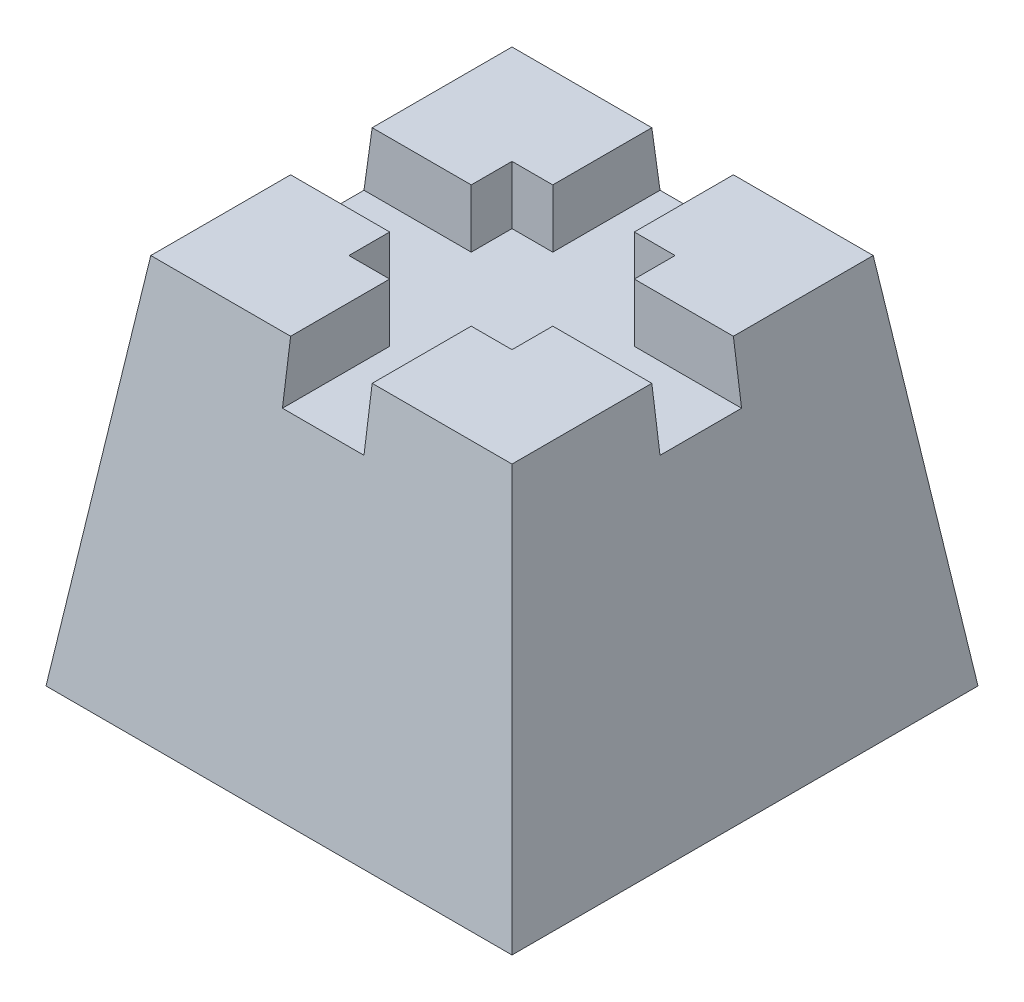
ISO-10303-21;
HEADER;
FILE_DESCRIPTION(('STEP AP214'),'2;1');
FILE_NAME('part.step','',(''),(''),'','','');
FILE_SCHEMA(('AUTOMOTIVE_DESIGN { 1 0 10303 214 1 1 1 1 }'));
ENDSEC;
DATA;
#1=APPLICATION_CONTEXT('core data for automotive mechanical design processes');
#2=APPLICATION_PROTOCOL_DEFINITION('international standard','automotive_design',2000,#1);
#3=PRODUCT_CONTEXT('',#1,'mechanical');
#4=PRODUCT('Part','Part','',(#3));
#5=PRODUCT_RELATED_PRODUCT_CATEGORY('part','',(#4));
#6=PRODUCT_DEFINITION_FORMATION('','',#4);
#7=PRODUCT_DEFINITION_CONTEXT('part definition',#1,'design');
#8=PRODUCT_DEFINITION('design','',#6,#7);
#9=PRODUCT_DEFINITION_SHAPE('','',#8);
#10=(LENGTH_UNIT() NAMED_UNIT(*) SI_UNIT(.MILLI.,.METRE.));
#11=(NAMED_UNIT(*) PLANE_ANGLE_UNIT() SI_UNIT($,.RADIAN.));
#12=(NAMED_UNIT(*) SI_UNIT($,.STERADIAN.) SOLID_ANGLE_UNIT());
#13=UNCERTAINTY_MEASURE_WITH_UNIT(LENGTH_MEASURE(1.E-05),#10,'distance_accuracy_value','');
#14=(GEOMETRIC_REPRESENTATION_CONTEXT(3) GLOBAL_UNCERTAINTY_ASSIGNED_CONTEXT((#13)) GLOBAL_UNIT_ASSIGNED_CONTEXT((#10,
#11,#12)) REPRESENTATION_CONTEXT('',''));
#15=CARTESIAN_POINT('',(0.,0.,0.));
#16=DIRECTION('',(0.,0.,1.));
#17=DIRECTION('',(1.,0.,0.));
#18=AXIS2_PLACEMENT_3D('',#15,#16,#17);
#19=CARTESIAN_POINT('',(-127.,203.2,127.));
#20=DIRECTION('',(0.,1.,0.));
#21=DIRECTION('',(0.,0.,1.));
#22=AXIS2_PLACEMENT_3D('',#19,#20,#21);
#23=PLANE('',#22);
#24=DIRECTION('',(0.,0.,-1.));
#25=VECTOR('',#24,1.);
#26=CARTESIAN_POINT('',(44.45,203.2,44.45));
#27=LINE('',#26,#25);
#28=CARTESIAN_POINT('',(44.45,203.2,-22.225));
#29=VERTEX_POINT('',#28);
#30=CARTESIAN_POINT('',(44.45,203.2,-44.45));
#31=VERTEX_POINT('',#30);
#32=EDGE_CURVE('E190',#29,#31,#27,.T.);
#33=ORIENTED_EDGE('',*,*,#32,.F.);
#34=DIRECTION('',(-1.,0.,0.));
#35=VECTOR('',#34,1.);
#36=CARTESIAN_POINT('',(-127.,203.2,-22.225));
#37=LINE('',#36,#35);
#38=CARTESIAN_POINT('',(98.4421023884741,203.2,-22.225));
#39=VERTEX_POINT('',#38);
#40=EDGE_CURVE('E343',#39,#29,#37,.T.);
#41=ORIENTED_EDGE('',*,*,#40,.F.);
#42=DIRECTION('',(0.,0.,1.));
#43=VECTOR('',#42,1.);
#44=CARTESIAN_POINT('',(98.442102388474,203.2,-127.));
#45=LINE('',#44,#43);
#46=CARTESIAN_POINT('',(98.442102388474,203.2,-98.442102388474));
#47=VERTEX_POINT('',#46);
#48=EDGE_CURVE('E330',#39,#47,#45,.F.);
#49=ORIENTED_EDGE('',*,*,#48,.T.);
#50=DIRECTION('',(1.,0.,0.));
#51=VECTOR('',#50,1.);
#52=CARTESIAN_POINT('',(-127.,203.2,-98.442102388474));
#53=LINE('',#52,#51);
#54=CARTESIAN_POINT('',(22.225,203.2,-98.442102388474));
#55=VERTEX_POINT('',#54);
#56=EDGE_CURVE('E319',#47,#55,#53,.F.);
#57=ORIENTED_EDGE('',*,*,#56,.T.);
#58=DIRECTION('',(0.,0.,-1.));
#59=VECTOR('',#58,1.);
#60=CARTESIAN_POINT('',(22.225,203.2,-127.));
#61=LINE('',#60,#59);
#62=CARTESIAN_POINT('',(22.225,203.2,-44.45));
#63=VERTEX_POINT('',#62);
#64=EDGE_CURVE('E213',#63,#55,#61,.T.);
#65=ORIENTED_EDGE('',*,*,#64,.F.);
#66=DIRECTION('',(-1.,0.,0.));
#67=VECTOR('',#66,1.);
#68=CARTESIAN_POINT('',(44.45,203.2,-44.45));
#69=LINE('',#68,#67);
#70=EDGE_CURVE('E204',#31,#63,#69,.T.);
#71=ORIENTED_EDGE('',*,*,#70,.F.);
#72=EDGE_LOOP('',(#33,#41,#49,#57,#65,#71));
#73=FACE_BOUND('',#72,.T.);
#74=ADVANCED_FACE('F27',(#73),#23,.T.);
#75=CARTESIAN_POINT('',(44.45,203.2,44.45));
#76=VERTEX_POINT('',#75);
#77=CARTESIAN_POINT('',(44.45,203.2,22.225));
#78=VERTEX_POINT('',#77);
#79=EDGE_CURVE('E200',#76,#78,#27,.T.);
#80=ORIENTED_EDGE('',*,*,#79,.F.);
#81=DIRECTION('',(1.,0.,0.));
#82=VECTOR('',#81,1.);
#83=CARTESIAN_POINT('',(44.45,203.2,44.45));
#84=LINE('',#83,#82);
#85=CARTESIAN_POINT('',(22.225,203.2,44.45));
#86=VERTEX_POINT('',#85);
#87=EDGE_CURVE('E221',#86,#76,#84,.T.);
#88=ORIENTED_EDGE('',*,*,#87,.F.);
#89=DIRECTION('',(0.,0.,-1.));
#90=VECTOR('',#89,1.);
#91=CARTESIAN_POINT('',(22.225,203.2,127.));
#92=LINE('',#91,#90);
#93=CARTESIAN_POINT('',(22.225,203.2,98.442102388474));
#94=VERTEX_POINT('',#93);
#95=EDGE_CURVE('E340',#94,#86,#92,.T.);
#96=ORIENTED_EDGE('',*,*,#95,.F.);
#97=DIRECTION('',(-1.,0.,0.));
#98=VECTOR('',#97,1.);
#99=CARTESIAN_POINT('',(-127.,203.2,98.442102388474));
#100=LINE('',#99,#98);
#101=CARTESIAN_POINT('',(98.4421023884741,203.2,98.442102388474));
#102=VERTEX_POINT('',#101);
#103=EDGE_CURVE('E326',#94,#102,#100,.F.);
#104=ORIENTED_EDGE('',*,*,#103,.T.);
#105=CARTESIAN_POINT('',(98.4421023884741,203.2,22.225));
#106=VERTEX_POINT('',#105);
#107=EDGE_CURVE('E331',#102,#106,#45,.F.);
#108=ORIENTED_EDGE('',*,*,#107,.T.);
#109=DIRECTION('',(1.,0.,0.));
#110=VECTOR('',#109,1.);
#111=CARTESIAN_POINT('',(22.225,203.2,22.225));
#112=LINE('',#111,#110);
#113=EDGE_CURVE('E247',#78,#106,#112,.T.);
#114=ORIENTED_EDGE('',*,*,#113,.F.);
#115=EDGE_LOOP('',(#80,#88,#96,#104,#108,#114));
#116=FACE_BOUND('',#115,.T.);
#117=ADVANCED_FACE('F362',(#116),#23,.T.);
#118=CARTESIAN_POINT('',(-44.45,203.2,44.45));
#119=VERTEX_POINT('',#118);
#120=CARTESIAN_POINT('',(-22.225,203.2,44.45));
#121=VERTEX_POINT('',#120);
#122=EDGE_CURVE('E209',#119,#121,#84,.T.);
#123=ORIENTED_EDGE('',*,*,#122,.F.);
#124=DIRECTION('',(0.,0.,1.));
#125=VECTOR('',#124,1.);
#126=CARTESIAN_POINT('',(-44.45,203.2,44.45));
#127=LINE('',#126,#125);
#128=CARTESIAN_POINT('',(-44.45,203.2,22.225));
#129=VERTEX_POINT('',#128);
#130=EDGE_CURVE('E214',#129,#119,#127,.T.);
#131=ORIENTED_EDGE('',*,*,#130,.F.);
#132=DIRECTION('',(1.,0.,0.));
#133=VECTOR('',#132,1.);
#134=CARTESIAN_POINT('',(-127.,203.2,22.225));
#135=LINE('',#134,#133);
#136=CARTESIAN_POINT('',(-98.442102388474,203.2,22.225));
#137=VERTEX_POINT('',#136);
#138=EDGE_CURVE('E337',#137,#129,#135,.T.);
#139=ORIENTED_EDGE('',*,*,#138,.F.);
#140=DIRECTION('',(0.,0.,-1.));
#141=VECTOR('',#140,1.);
#142=CARTESIAN_POINT('',(-98.442102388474,203.2,-127.));
#143=LINE('',#142,#141);
#144=CARTESIAN_POINT('',(-98.442102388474,203.2,98.442102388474));
#145=VERTEX_POINT('',#144);
#146=EDGE_CURVE('E309',#137,#145,#143,.F.);
#147=ORIENTED_EDGE('',*,*,#146,.T.);
#148=CARTESIAN_POINT('',(-22.225,203.2,98.442102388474));
#149=VERTEX_POINT('',#148);
#150=EDGE_CURVE('E327',#145,#149,#100,.F.);
#151=ORIENTED_EDGE('',*,*,#150,.T.);
#152=DIRECTION('',(0.,0.,1.));
#153=VECTOR('',#152,1.);
#154=CARTESIAN_POINT('',(-22.225,203.2,22.225));
#155=LINE('',#154,#153);
#156=EDGE_CURVE('E245',#121,#149,#155,.T.);
#157=ORIENTED_EDGE('',*,*,#156,.F.);
#158=EDGE_LOOP('',(#123,#131,#139,#147,#151,#157));
#159=FACE_BOUND('',#158,.T.);
#160=ADVANCED_FACE('F427',(#159),#23,.T.);
#161=CARTESIAN_POINT('',(-127.,0.,-127.));
#162=DIRECTION('',(-0.99026806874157,0.139173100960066,0.));
#163=DIRECTION('',(-0.139173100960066,-0.99026806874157,0.));
#164=AXIS2_PLACEMENT_3D('',#161,#162,#163);
#165=PLANE('',#164);
#166=ORIENTED_EDGE('',*,*,#146,.F.);
#167=DIRECTION('',(0.139173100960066,0.99026806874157,0.));
#168=VECTOR('',#167,1.);
#169=CARTESIAN_POINT('',(-127.,0.,22.225));
#170=LINE('',#169,#168);
#171=CARTESIAN_POINT('',(-102.904273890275,171.45,22.225));
#172=VERTEX_POINT('',#171);
#173=EDGE_CURVE('E273',#137,#172,#170,.F.);
#174=ORIENTED_EDGE('',*,*,#173,.T.);
#175=DIRECTION('',(0.,0.,-1.));
#176=VECTOR('',#175,1.);
#177=CARTESIAN_POINT('',(-102.904273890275,171.45,-127.));
#178=LINE('',#177,#176);
#179=CARTESIAN_POINT('',(-102.904273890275,171.45,-22.225));
#180=VERTEX_POINT('',#179);
#181=EDGE_CURVE('E298',#180,#172,#178,.F.);
#182=ORIENTED_EDGE('',*,*,#181,.F.);
#183=DIRECTION('',(-0.139173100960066,-0.99026806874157,0.));
#184=VECTOR('',#183,1.);
#185=CARTESIAN_POINT('',(-127.,0.,-22.225));
#186=LINE('',#185,#184);
#187=CARTESIAN_POINT('',(-98.442102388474,203.2,-22.225));
#188=VERTEX_POINT('',#187);
#189=EDGE_CURVE('E270',#180,#188,#186,.F.);
#190=ORIENTED_EDGE('',*,*,#189,.T.);
#191=CARTESIAN_POINT('',(-98.442102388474,203.2,-98.442102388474));
#192=VERTEX_POINT('',#191);
#193=EDGE_CURVE('E324',#192,#188,#143,.F.);
#194=ORIENTED_EDGE('',*,*,#193,.F.);
#195=DIRECTION('',(-0.137844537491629,-0.980814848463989,-0.137844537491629));
#196=VECTOR('',#195,1.);
#197=CARTESIAN_POINT('',(-127.,0.,-127.));
#198=LINE('',#197,#196);
#199=CARTESIAN_POINT('',(-127.,0.,-127.));
#200=VERTEX_POINT('',#199);
#201=EDGE_CURVE('E315',#192,#200,#198,.T.);
#202=ORIENTED_EDGE('',*,*,#201,.T.);
#203=DIRECTION('',(0.,0.,1.));
#204=VECTOR('',#203,1.);
#205=CARTESIAN_POINT('',(-127.,0.,-127.));
#206=LINE('',#205,#204);
#207=CARTESIAN_POINT('',(-127.,0.,127.));
#208=VERTEX_POINT('',#207);
#209=EDGE_CURVE('E300',#200,#208,#206,.T.);
#210=ORIENTED_EDGE('',*,*,#209,.T.);
#211=DIRECTION('',(-0.137844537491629,-0.980814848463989,0.137844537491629));
#212=VECTOR('',#211,1.);
#213=CARTESIAN_POINT('',(-127.,0.,127.));
#214=LINE('',#213,#212);
#215=EDGE_CURVE('E310',#145,#208,#214,.T.);
#216=ORIENTED_EDGE('',*,*,#215,.F.);
#217=EDGE_LOOP('',(#166,#174,#182,#190,#194,#202,#210,#216));
#218=FACE_BOUND('',#217,.T.);
#219=ADVANCED_FACE('F412',(#218),#165,.T.);
#220=CARTESIAN_POINT('',(-127.,0.,127.));
#221=DIRECTION('',(0.,0.139173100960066,0.99026806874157));
#222=DIRECTION('',(0.,-0.99026806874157,0.139173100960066));
#223=AXIS2_PLACEMENT_3D('',#220,#221,#222);
#224=PLANE('',#223);
#225=ORIENTED_EDGE('',*,*,#103,.F.);
#226=DIRECTION('',(0.,0.99026806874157,-0.139173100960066));
#227=VECTOR('',#226,1.);
#228=CARTESIAN_POINT('',(22.225,0.,127.));
#229=LINE('',#228,#227);
#230=CARTESIAN_POINT('',(22.225,171.45,102.904273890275));
#231=VERTEX_POINT('',#230);
#232=EDGE_CURVE('E279',#94,#231,#229,.F.);
#233=ORIENTED_EDGE('',*,*,#232,.T.);
#234=DIRECTION('',(-1.,0.,0.));
#235=VECTOR('',#234,1.);
#236=CARTESIAN_POINT('',(-127.,171.45,102.904273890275));
#237=LINE('',#236,#235);
#238=CARTESIAN_POINT('',(-22.225,171.45,102.904273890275));
#239=VERTEX_POINT('',#238);
#240=EDGE_CURVE('E296',#239,#231,#237,.F.);
#241=ORIENTED_EDGE('',*,*,#240,.F.);
#242=DIRECTION('',(0.,-0.99026806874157,0.139173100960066));
#243=VECTOR('',#242,1.);
#244=CARTESIAN_POINT('',(-22.225,0.,127.));
#245=LINE('',#244,#243);
#246=EDGE_CURVE('E276',#239,#149,#245,.F.);
#247=ORIENTED_EDGE('',*,*,#246,.T.);
#248=ORIENTED_EDGE('',*,*,#150,.F.);
#249=ORIENTED_EDGE('',*,*,#215,.T.);
#250=DIRECTION('',(1.,0.,0.));
#251=VECTOR('',#250,1.);
#252=CARTESIAN_POINT('',(-127.,0.,127.));
#253=LINE('',#252,#251);
#254=CARTESIAN_POINT('',(127.,0.,127.));
#255=VERTEX_POINT('',#254);
#256=EDGE_CURVE('E303',#208,#255,#253,.T.);
#257=ORIENTED_EDGE('',*,*,#256,.T.);
#258=DIRECTION('',(0.137844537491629,-0.980814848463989,0.137844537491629));
#259=VECTOR('',#258,1.);
#260=CARTESIAN_POINT('',(122.173716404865,34.3407921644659,122.173716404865));
#261=LINE('',#260,#259);
#262=EDGE_CURVE('E314',#102,#255,#261,.T.);
#263=ORIENTED_EDGE('',*,*,#262,.F.);
#264=EDGE_LOOP('',(#225,#233,#241,#247,#248,#249,#257,#263));
#265=FACE_BOUND('',#264,.T.);
#266=ADVANCED_FACE('F29',(#265),#224,.T.);
#267=CARTESIAN_POINT('',(127.,0.,-127.));
#268=DIRECTION('',(0.99026806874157,0.139173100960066,0.));
#269=DIRECTION('',(-0.139173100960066,0.99026806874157,0.));
#270=AXIS2_PLACEMENT_3D('',#267,#268,#269);
#271=PLANE('',#270);
#272=ORIENTED_EDGE('',*,*,#48,.F.);
#273=DIRECTION('',(-0.139173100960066,0.99026806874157,0.));
#274=VECTOR('',#273,1.);
#275=CARTESIAN_POINT('',(127.,0.,-22.225));
#276=LINE('',#275,#274);
#277=CARTESIAN_POINT('',(102.904273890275,171.45,-22.225));
#278=VERTEX_POINT('',#277);
#279=EDGE_CURVE('E285',#39,#278,#276,.F.);
#280=ORIENTED_EDGE('',*,*,#279,.T.);
#281=DIRECTION('',(0.,0.,1.));
#282=VECTOR('',#281,1.);
#283=CARTESIAN_POINT('',(102.904273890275,171.45,-127.));
#284=LINE('',#283,#282);
#285=CARTESIAN_POINT('',(102.904273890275,171.45,22.225));
#286=VERTEX_POINT('',#285);
#287=EDGE_CURVE('E294',#286,#278,#284,.F.);
#288=ORIENTED_EDGE('',*,*,#287,.F.);
#289=DIRECTION('',(0.139173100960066,-0.99026806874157,0.));
#290=VECTOR('',#289,1.);
#291=CARTESIAN_POINT('',(127.,0.,22.225));
#292=LINE('',#291,#290);
#293=EDGE_CURVE('E282',#286,#106,#292,.F.);
#294=ORIENTED_EDGE('',*,*,#293,.T.);
#295=ORIENTED_EDGE('',*,*,#107,.F.);
#296=ORIENTED_EDGE('',*,*,#262,.T.);
#297=DIRECTION('',(0.,0.,-1.));
#298=VECTOR('',#297,1.);
#299=CARTESIAN_POINT('',(127.,0.,-127.));
#300=LINE('',#299,#298);
#301=CARTESIAN_POINT('',(127.,0.,-127.));
#302=VERTEX_POINT('',#301);
#303=EDGE_CURVE('E305',#255,#302,#300,.T.);
#304=ORIENTED_EDGE('',*,*,#303,.T.);
#305=DIRECTION('',(0.137844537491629,-0.980814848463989,-0.137844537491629));
#306=VECTOR('',#305,1.);
#307=CARTESIAN_POINT('',(122.173716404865,34.3407921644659,-122.173716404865));
#308=LINE('',#307,#306);
#309=EDGE_CURVE('E318',#47,#302,#308,.T.);
#310=ORIENTED_EDGE('',*,*,#309,.F.);
#311=EDGE_LOOP('',(#272,#280,#288,#294,#295,#296,#304,#310));
#312=FACE_BOUND('',#311,.T.);
#313=ADVANCED_FACE('F370',(#312),#271,.T.);
#314=CARTESIAN_POINT('',(-127.,0.,-127.));
#315=DIRECTION('',(0.,0.139173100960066,-0.99026806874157));
#316=DIRECTION('',(0.,0.99026806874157,0.139173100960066));
#317=AXIS2_PLACEMENT_3D('',#314,#315,#316);
#318=PLANE('',#317);
#319=CARTESIAN_POINT('',(-22.225,203.2,-98.442102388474));
#320=VERTEX_POINT('',#319);
#321=EDGE_CURVE('E50',#320,#192,#53,.F.);
#322=ORIENTED_EDGE('',*,*,#321,.F.);
#323=DIRECTION('',(0.,0.99026806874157,0.139173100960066));
#324=VECTOR('',#323,1.);
#325=CARTESIAN_POINT('',(-22.225,0.,-127.));
#326=LINE('',#325,#324);
#327=CARTESIAN_POINT('',(-22.225,171.45,-102.904273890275));
#328=VERTEX_POINT('',#327);
#329=EDGE_CURVE('E291',#320,#328,#326,.F.);
#330=ORIENTED_EDGE('',*,*,#329,.T.);
#331=DIRECTION('',(1.,0.,0.));
#332=VECTOR('',#331,1.);
#333=CARTESIAN_POINT('',(-127.,171.45,-102.904273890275));
#334=LINE('',#333,#332);
#335=CARTESIAN_POINT('',(22.225,171.45,-102.904273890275));
#336=VERTEX_POINT('',#335);
#337=EDGE_CURVE('E345',#336,#328,#334,.F.);
#338=ORIENTED_EDGE('',*,*,#337,.F.);
#339=DIRECTION('',(0.,-0.99026806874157,-0.139173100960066));
#340=VECTOR('',#339,1.);
#341=CARTESIAN_POINT('',(22.225,0.,-127.));
#342=LINE('',#341,#340);
#343=EDGE_CURVE('E288',#336,#55,#342,.F.);
#344=ORIENTED_EDGE('',*,*,#343,.T.);
#345=ORIENTED_EDGE('',*,*,#56,.F.);
#346=ORIENTED_EDGE('',*,*,#309,.T.);
#347=DIRECTION('',(-1.,0.,0.));
#348=VECTOR('',#347,1.);
#349=CARTESIAN_POINT('',(-127.,0.,-127.));
#350=LINE('',#349,#348);
#351=EDGE_CURVE('E307',#302,#200,#350,.T.);
#352=ORIENTED_EDGE('',*,*,#351,.T.);
#353=ORIENTED_EDGE('',*,*,#201,.F.);
#354=EDGE_LOOP('',(#322,#330,#338,#344,#345,#346,#352,#353));
#355=FACE_BOUND('',#354,.T.);
#356=ADVANCED_FACE('F381',(#355),#318,.T.);
#357=CARTESIAN_POINT('',(-44.45,203.2,-44.45));
#358=VERTEX_POINT('',#357);
#359=CARTESIAN_POINT('',(-44.45,203.2,-22.225));
#360=VERTEX_POINT('',#359);
#361=EDGE_CURVE('E217',#358,#360,#127,.T.);
#362=ORIENTED_EDGE('',*,*,#361,.F.);
#363=CARTESIAN_POINT('',(-22.225,203.2,-44.45));
#364=VERTEX_POINT('',#363);
#365=EDGE_CURVE('E215',#364,#358,#69,.T.);
#366=ORIENTED_EDGE('',*,*,#365,.F.);
#367=DIRECTION('',(0.,0.,1.));
#368=VECTOR('',#367,1.);
#369=CARTESIAN_POINT('',(-22.225,203.2,127.));
#370=LINE('',#369,#368);
#371=EDGE_CURVE('E313',#320,#364,#370,.T.);
#372=ORIENTED_EDGE('',*,*,#371,.F.);
#373=ORIENTED_EDGE('',*,*,#321,.T.);
#374=ORIENTED_EDGE('',*,*,#193,.T.);
#375=DIRECTION('',(-1.,0.,0.));
#376=VECTOR('',#375,1.);
#377=CARTESIAN_POINT('',(-127.,203.2,-22.225));
#378=LINE('',#377,#376);
#379=EDGE_CURVE('E243',#360,#188,#378,.T.);
#380=ORIENTED_EDGE('',*,*,#379,.F.);
#381=EDGE_LOOP('',(#362,#366,#372,#373,#374,#380));
#382=FACE_BOUND('',#381,.T.);
#383=ADVANCED_FACE('F416',(#382),#23,.T.);
#384=CARTESIAN_POINT('',(-127.,0.,127.));
#385=DIRECTION('',(0.,1.,0.));
#386=DIRECTION('',(0.,0.,1.));
#387=AXIS2_PLACEMENT_3D('',#384,#385,#386);
#388=PLANE('',#387);
#389=ORIENTED_EDGE('',*,*,#209,.F.);
#390=ORIENTED_EDGE('',*,*,#351,.F.);
#391=ORIENTED_EDGE('',*,*,#303,.F.);
#392=ORIENTED_EDGE('',*,*,#256,.F.);
#393=EDGE_LOOP('',(#389,#390,#391,#392));
#394=FACE_BOUND('',#393,.T.);
#395=ADVANCED_FACE('F459',(#394),#388,.F.);
#396=CARTESIAN_POINT('',(-22.225,171.45,127.));
#397=DIRECTION('',(0.,1.,0.));
#398=DIRECTION('',(0.,0.,1.));
#399=AXIS2_PLACEMENT_3D('',#396,#397,#398);
#400=PLANE('',#399);
#401=DIRECTION('',(0.,0.,1.));
#402=VECTOR('',#401,1.);
#403=CARTESIAN_POINT('',(-22.225,171.45,-127.));
#404=LINE('',#403,#402);
#405=CARTESIAN_POINT('',(-22.225,171.45,-44.45));
#406=VERTEX_POINT('',#405);
#407=EDGE_CURVE('E250',#328,#406,#404,.T.);
#408=ORIENTED_EDGE('',*,*,#407,.T.);
#409=DIRECTION('',(1.,0.,0.));
#410=VECTOR('',#409,1.);
#411=CARTESIAN_POINT('',(44.45,171.45,-44.45));
#412=LINE('',#411,#410);
#413=CARTESIAN_POINT('',(-44.45,171.45,-44.45));
#414=VERTEX_POINT('',#413);
#415=EDGE_CURVE('E231',#414,#406,#412,.T.);
#416=ORIENTED_EDGE('',*,*,#415,.F.);
#417=DIRECTION('',(0.,0.,-1.));
#418=VECTOR('',#417,1.);
#419=CARTESIAN_POINT('',(-44.45,171.45,44.45));
#420=LINE('',#419,#418);
#421=CARTESIAN_POINT('',(-44.45,171.45,-22.225));
#422=VERTEX_POINT('',#421);
#423=EDGE_CURVE('E42',#422,#414,#420,.T.);
#424=ORIENTED_EDGE('',*,*,#423,.F.);
#425=DIRECTION('',(-1.,0.,0.));
#426=VECTOR('',#425,1.);
#427=CARTESIAN_POINT('',(-127.,171.45,-22.225));
#428=LINE('',#427,#426);
#429=EDGE_CURVE('E253',#422,#180,#428,.T.);
#430=ORIENTED_EDGE('',*,*,#429,.T.);
#431=ORIENTED_EDGE('',*,*,#181,.T.);
#432=DIRECTION('',(1.,0.,0.));
#433=VECTOR('',#432,1.);
#434=CARTESIAN_POINT('',(-127.,171.45,22.225));
#435=LINE('',#434,#433);
#436=CARTESIAN_POINT('',(-44.45,171.45,22.225));
#437=VERTEX_POINT('',#436);
#438=EDGE_CURVE('E255',#172,#437,#435,.T.);
#439=ORIENTED_EDGE('',*,*,#438,.T.);
#440=CARTESIAN_POINT('',(-44.45,171.45,44.45));
#441=VERTEX_POINT('',#440);
#442=EDGE_CURVE('E393',#441,#437,#420,.T.);
#443=ORIENTED_EDGE('',*,*,#442,.F.);
#444=DIRECTION('',(-1.,0.,0.));
#445=VECTOR('',#444,1.);
#446=CARTESIAN_POINT('',(44.45,171.45,44.45));
#447=LINE('',#446,#445);
#448=CARTESIAN_POINT('',(-22.225,171.45,44.45));
#449=VERTEX_POINT('',#448);
#450=EDGE_CURVE('E392',#449,#441,#447,.T.);
#451=ORIENTED_EDGE('',*,*,#450,.F.);
#452=DIRECTION('',(0.,0.,1.));
#453=VECTOR('',#452,1.);
#454=CARTESIAN_POINT('',(-22.225,171.45,22.225));
#455=LINE('',#454,#453);
#456=EDGE_CURVE('E258',#449,#239,#455,.T.);
#457=ORIENTED_EDGE('',*,*,#456,.T.);
#458=ORIENTED_EDGE('',*,*,#240,.T.);
#459=DIRECTION('',(0.,0.,-1.));
#460=VECTOR('',#459,1.);
#461=CARTESIAN_POINT('',(22.225,171.45,22.225));
#462=LINE('',#461,#460);
#463=CARTESIAN_POINT('',(22.225,171.45,44.45));
#464=VERTEX_POINT('',#463);
#465=EDGE_CURVE('E260',#231,#464,#462,.T.);
#466=ORIENTED_EDGE('',*,*,#465,.T.);
#467=CARTESIAN_POINT('',(44.45,171.45,44.45));
#468=VERTEX_POINT('',#467);
#469=EDGE_CURVE('E389',#468,#464,#447,.T.);
#470=ORIENTED_EDGE('',*,*,#469,.F.);
#471=DIRECTION('',(0.,0.,1.));
#472=VECTOR('',#471,1.);
#473=CARTESIAN_POINT('',(44.45,171.45,44.45));
#474=LINE('',#473,#472);
#475=CARTESIAN_POINT('',(44.45,171.45,22.225));
#476=VERTEX_POINT('',#475);
#477=EDGE_CURVE('E388',#476,#468,#474,.T.);
#478=ORIENTED_EDGE('',*,*,#477,.F.);
#479=DIRECTION('',(1.,0.,0.));
#480=VECTOR('',#479,1.);
#481=CARTESIAN_POINT('',(22.225,171.45,22.225));
#482=LINE('',#481,#480);
#483=EDGE_CURVE('E263',#476,#286,#482,.T.);
#484=ORIENTED_EDGE('',*,*,#483,.T.);
#485=ORIENTED_EDGE('',*,*,#287,.T.);
#486=DIRECTION('',(-1.,0.,0.));
#487=VECTOR('',#486,1.);
#488=CARTESIAN_POINT('',(22.225,171.45,-22.225));
#489=LINE('',#488,#487);
#490=CARTESIAN_POINT('',(44.45,171.45,-22.225));
#491=VERTEX_POINT('',#490);
#492=EDGE_CURVE('E265',#278,#491,#489,.T.);
#493=ORIENTED_EDGE('',*,*,#492,.T.);
#494=CARTESIAN_POINT('',(44.45,171.45,-44.45));
#495=VERTEX_POINT('',#494);
#496=EDGE_CURVE('E387',#495,#491,#474,.T.);
#497=ORIENTED_EDGE('',*,*,#496,.F.);
#498=CARTESIAN_POINT('',(22.225,171.45,-44.45));
#499=VERTEX_POINT('',#498);
#500=EDGE_CURVE('E206',#499,#495,#412,.T.);
#501=ORIENTED_EDGE('',*,*,#500,.F.);
#502=DIRECTION('',(0.,0.,-1.));
#503=VECTOR('',#502,1.);
#504=CARTESIAN_POINT('',(22.225,171.45,-127.));
#505=LINE('',#504,#503);
#506=EDGE_CURVE('E268',#499,#336,#505,.T.);
#507=ORIENTED_EDGE('',*,*,#506,.T.);
#508=ORIENTED_EDGE('',*,*,#337,.T.);
#509=EDGE_LOOP('',(#408,#416,#424,#430,#431,#439,#443,#451,#457,#458,#466,#470,#478,#484,#485,
#493,#497,#501,#507,#508));
#510=FACE_BOUND('',#509,.T.);
#511=ADVANCED_FACE('F374',(#510),#400,.T.);
#512=CARTESIAN_POINT('',(-22.225,171.45,-127.));
#513=DIRECTION('',(-1.,0.,0.));
#514=DIRECTION('',(0.,0.,1.));
#515=AXIS2_PLACEMENT_3D('',#512,#513,#514);
#516=PLANE('',#515);
#517=ORIENTED_EDGE('',*,*,#371,.T.);
#518=DIRECTION('',(0.,-1.,0.));
#519=VECTOR('',#518,1.);
#520=CARTESIAN_POINT('',(-22.225,171.45,-44.45));
#521=LINE('',#520,#519);
#522=EDGE_CURVE('E240',#364,#406,#521,.T.);
#523=ORIENTED_EDGE('',*,*,#522,.T.);
#524=ORIENTED_EDGE('',*,*,#407,.F.);
#525=ORIENTED_EDGE('',*,*,#329,.F.);
#526=EDGE_LOOP('',(#517,#523,#524,#525));
#527=FACE_BOUND('',#526,.T.);
#528=ADVANCED_FACE('F407',(#527),#516,.F.);
#529=CARTESIAN_POINT('',(22.225,171.45,-127.));
#530=DIRECTION('',(1.,0.,0.));
#531=DIRECTION('',(0.,0.,-1.));
#532=AXIS2_PLACEMENT_3D('',#529,#530,#531);
#533=PLANE('',#532);
#534=ORIENTED_EDGE('',*,*,#506,.F.);
#535=DIRECTION('',(0.,1.,0.));
#536=VECTOR('',#535,1.);
#537=CARTESIAN_POINT('',(22.225,171.45,-44.45));
#538=LINE('',#537,#536);
#539=EDGE_CURVE('E11',#499,#63,#538,.T.);
#540=ORIENTED_EDGE('',*,*,#539,.T.);
#541=ORIENTED_EDGE('',*,*,#64,.T.);
#542=ORIENTED_EDGE('',*,*,#343,.F.);
#543=EDGE_LOOP('',(#534,#540,#541,#542));
#544=FACE_BOUND('',#543,.T.);
#545=ADVANCED_FACE('F386',(#544),#533,.F.);
#546=CARTESIAN_POINT('',(22.225,171.45,-22.225));
#547=DIRECTION('',(0.,0.,-1.));
#548=DIRECTION('',(-1.,0.,0.));
#549=AXIS2_PLACEMENT_3D('',#546,#547,#548);
#550=PLANE('',#549);
#551=ORIENTED_EDGE('',*,*,#40,.T.);
#552=DIRECTION('',(0.,-1.,0.));
#553=VECTOR('',#552,1.);
#554=CARTESIAN_POINT('',(44.45,171.45,-22.225));
#555=LINE('',#554,#553);
#556=EDGE_CURVE('E195',#29,#491,#555,.T.);
#557=ORIENTED_EDGE('',*,*,#556,.T.);
#558=ORIENTED_EDGE('',*,*,#492,.F.);
#559=ORIENTED_EDGE('',*,*,#279,.F.);
#560=EDGE_LOOP('',(#551,#557,#558,#559));
#561=FACE_BOUND('',#560,.T.);
#562=ADVANCED_FACE('F376',(#561),#550,.F.);
#563=CARTESIAN_POINT('',(22.225,171.45,22.225));
#564=DIRECTION('',(0.,0.,1.));
#565=DIRECTION('',(1.,0.,0.));
#566=AXIS2_PLACEMENT_3D('',#563,#564,#565);
#567=PLANE('',#566);
#568=ORIENTED_EDGE('',*,*,#483,.F.);
#569=DIRECTION('',(0.,1.,0.));
#570=VECTOR('',#569,1.);
#571=CARTESIAN_POINT('',(44.45,171.45,22.225));
#572=LINE('',#571,#570);
#573=EDGE_CURVE('E35',#476,#78,#572,.T.);
#574=ORIENTED_EDGE('',*,*,#573,.T.);
#575=ORIENTED_EDGE('',*,*,#113,.T.);
#576=ORIENTED_EDGE('',*,*,#293,.F.);
#577=EDGE_LOOP('',(#568,#574,#575,#576));
#578=FACE_BOUND('',#577,.T.);
#579=ADVANCED_FACE('F356',(#578),#567,.F.);
#580=CARTESIAN_POINT('',(22.225,171.45,22.225));
#581=DIRECTION('',(1.,0.,0.));
#582=DIRECTION('',(0.,0.,-1.));
#583=AXIS2_PLACEMENT_3D('',#580,#581,#582);
#584=PLANE('',#583);
#585=ORIENTED_EDGE('',*,*,#95,.T.);
#586=DIRECTION('',(0.,-1.,0.));
#587=VECTOR('',#586,1.);
#588=CARTESIAN_POINT('',(22.225,171.45,44.45));
#589=LINE('',#588,#587);
#590=EDGE_CURVE('E236',#86,#464,#589,.T.);
#591=ORIENTED_EDGE('',*,*,#590,.T.);
#592=ORIENTED_EDGE('',*,*,#465,.F.);
#593=ORIENTED_EDGE('',*,*,#232,.F.);
#594=EDGE_LOOP('',(#585,#591,#592,#593));
#595=FACE_BOUND('',#594,.T.);
#596=ADVANCED_FACE('F530',(#595),#584,.F.);
#597=CARTESIAN_POINT('',(-22.225,171.45,22.225));
#598=DIRECTION('',(-1.,0.,0.));
#599=DIRECTION('',(0.,0.,1.));
#600=AXIS2_PLACEMENT_3D('',#597,#598,#599);
#601=PLANE('',#600);
#602=ORIENTED_EDGE('',*,*,#456,.F.);
#603=DIRECTION('',(0.,1.,0.));
#604=VECTOR('',#603,1.);
#605=CARTESIAN_POINT('',(-22.225,171.45,44.45));
#606=LINE('',#605,#604);
#607=EDGE_CURVE('E350',#449,#121,#606,.T.);
#608=ORIENTED_EDGE('',*,*,#607,.T.);
#609=ORIENTED_EDGE('',*,*,#156,.T.);
#610=ORIENTED_EDGE('',*,*,#246,.F.);
#611=EDGE_LOOP('',(#602,#608,#609,#610));
#612=FACE_BOUND('',#611,.T.);
#613=ADVANCED_FACE('F435',(#612),#601,.F.);
#614=CARTESIAN_POINT('',(-127.,171.45,22.225));
#615=DIRECTION('',(0.,0.,1.));
#616=DIRECTION('',(1.,0.,0.));
#617=AXIS2_PLACEMENT_3D('',#614,#615,#616);
#618=PLANE('',#617);
#619=ORIENTED_EDGE('',*,*,#138,.T.);
#620=DIRECTION('',(0.,-1.,0.));
#621=VECTOR('',#620,1.);
#622=CARTESIAN_POINT('',(-44.45,171.45,22.225));
#623=LINE('',#622,#621);
#624=EDGE_CURVE('E233',#129,#437,#623,.T.);
#625=ORIENTED_EDGE('',*,*,#624,.T.);
#626=ORIENTED_EDGE('',*,*,#438,.F.);
#627=ORIENTED_EDGE('',*,*,#173,.F.);
#628=EDGE_LOOP('',(#619,#625,#626,#627));
#629=FACE_BOUND('',#628,.T.);
#630=ADVANCED_FACE('F421',(#629),#618,.F.);
#631=CARTESIAN_POINT('',(-127.,171.45,-22.225));
#632=DIRECTION('',(0.,0.,-1.));
#633=DIRECTION('',(-1.,0.,0.));
#634=AXIS2_PLACEMENT_3D('',#631,#632,#633);
#635=PLANE('',#634);
#636=ORIENTED_EDGE('',*,*,#429,.F.);
#637=DIRECTION('',(0.,1.,0.));
#638=VECTOR('',#637,1.);
#639=CARTESIAN_POINT('',(-44.45,171.45,-22.225));
#640=LINE('',#639,#638);
#641=EDGE_CURVE('E347',#422,#360,#640,.T.);
#642=ORIENTED_EDGE('',*,*,#641,.T.);
#643=ORIENTED_EDGE('',*,*,#379,.T.);
#644=ORIENTED_EDGE('',*,*,#189,.F.);
#645=EDGE_LOOP('',(#636,#642,#643,#644));
#646=FACE_BOUND('',#645,.T.);
#647=ADVANCED_FACE('F418',(#646),#635,.F.);
#648=CARTESIAN_POINT('',(-44.45,45.7264143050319,44.45));
#649=DIRECTION('',(-1.,0.,0.));
#650=DIRECTION('',(0.,0.,1.));
#651=AXIS2_PLACEMENT_3D('',#648,#649,#650);
#652=PLANE('',#651);
#653=ORIENTED_EDGE('',*,*,#423,.T.);
#654=DIRECTION('',(0.,1.,0.));
#655=VECTOR('',#654,1.);
#656=CARTESIAN_POINT('',(-44.45,45.7264143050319,-44.45));
#657=LINE('',#656,#655);
#658=EDGE_CURVE('E208',#414,#358,#657,.T.);
#659=ORIENTED_EDGE('',*,*,#658,.T.);
#660=ORIENTED_EDGE('',*,*,#361,.T.);
#661=ORIENTED_EDGE('',*,*,#641,.F.);
#662=EDGE_LOOP('',(#653,#659,#660,#661));
#663=FACE_BOUND('',#662,.T.);
#664=ADVANCED_FACE('F399',(#663),#652,.F.);
#665=CARTESIAN_POINT('',(44.45,45.7264143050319,-44.45));
#666=DIRECTION('',(0.,0.,-1.));
#667=DIRECTION('',(-1.,0.,0.));
#668=AXIS2_PLACEMENT_3D('',#665,#666,#667);
#669=PLANE('',#668);
#670=ORIENTED_EDGE('',*,*,#365,.T.);
#671=ORIENTED_EDGE('',*,*,#658,.F.);
#672=ORIENTED_EDGE('',*,*,#415,.T.);
#673=ORIENTED_EDGE('',*,*,#522,.F.);
#674=EDGE_LOOP('',(#670,#671,#672,#673));
#675=FACE_BOUND('',#674,.T.);
#676=ADVANCED_FACE('F403',(#675),#669,.F.);
#677=ORIENTED_EDGE('',*,*,#130,.T.);
#678=DIRECTION('',(0.,1.,0.));
#679=VECTOR('',#678,1.);
#680=CARTESIAN_POINT('',(-44.45,45.7264143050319,44.45));
#681=LINE('',#680,#679);
#682=EDGE_CURVE('E226',#441,#119,#681,.T.);
#683=ORIENTED_EDGE('',*,*,#682,.F.);
#684=ORIENTED_EDGE('',*,*,#442,.T.);
#685=ORIENTED_EDGE('',*,*,#624,.F.);
#686=EDGE_LOOP('',(#677,#683,#684,#685));
#687=FACE_BOUND('',#686,.T.);
#688=ADVANCED_FACE('F439',(#687),#652,.F.);
#689=CARTESIAN_POINT('',(44.45,45.7264143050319,44.45));
#690=DIRECTION('',(0.,0.,1.));
#691=DIRECTION('',(1.,0.,0.));
#692=AXIS2_PLACEMENT_3D('',#689,#690,#691);
#693=PLANE('',#692);
#694=ORIENTED_EDGE('',*,*,#450,.T.);
#695=ORIENTED_EDGE('',*,*,#682,.T.);
#696=ORIENTED_EDGE('',*,*,#122,.T.);
#697=ORIENTED_EDGE('',*,*,#607,.F.);
#698=EDGE_LOOP('',(#694,#695,#696,#697));
#699=FACE_BOUND('',#698,.T.);
#700=ADVANCED_FACE('F437',(#699),#693,.F.);
#701=ORIENTED_EDGE('',*,*,#87,.T.);
#702=DIRECTION('',(0.,1.,0.));
#703=VECTOR('',#702,1.);
#704=CARTESIAN_POINT('',(44.45,45.7264143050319,44.45));
#705=LINE('',#704,#703);
#706=EDGE_CURVE('E223',#468,#76,#705,.T.);
#707=ORIENTED_EDGE('',*,*,#706,.F.);
#708=ORIENTED_EDGE('',*,*,#469,.T.);
#709=ORIENTED_EDGE('',*,*,#590,.F.);
#710=EDGE_LOOP('',(#701,#707,#708,#709));
#711=FACE_BOUND('',#710,.T.);
#712=ADVANCED_FACE('F446',(#711),#693,.F.);
#713=CARTESIAN_POINT('',(44.45,45.7264143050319,44.45));
#714=DIRECTION('',(1.,0.,0.));
#715=DIRECTION('',(0.,0.,-1.));
#716=AXIS2_PLACEMENT_3D('',#713,#714,#715);
#717=PLANE('',#716);
#718=ORIENTED_EDGE('',*,*,#477,.T.);
#719=ORIENTED_EDGE('',*,*,#706,.T.);
#720=ORIENTED_EDGE('',*,*,#79,.T.);
#721=ORIENTED_EDGE('',*,*,#573,.F.);
#722=EDGE_LOOP('',(#718,#719,#720,#721));
#723=FACE_BOUND('',#722,.T.);
#724=ADVANCED_FACE('F574',(#723),#717,.F.);
#725=ORIENTED_EDGE('',*,*,#500,.T.);
#726=DIRECTION('',(0.,1.,0.));
#727=VECTOR('',#726,1.);
#728=CARTESIAN_POINT('',(44.45,45.7264143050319,-44.45));
#729=LINE('',#728,#727);
#730=EDGE_CURVE('E193',#495,#31,#729,.T.);
#731=ORIENTED_EDGE('',*,*,#730,.T.);
#732=ORIENTED_EDGE('',*,*,#70,.T.);
#733=ORIENTED_EDGE('',*,*,#539,.F.);
#734=EDGE_LOOP('',(#725,#731,#732,#733));
#735=FACE_BOUND('',#734,.T.);
#736=ADVANCED_FACE('F203',(#735),#669,.F.);
#737=ORIENTED_EDGE('',*,*,#32,.T.);
#738=ORIENTED_EDGE('',*,*,#730,.F.);
#739=ORIENTED_EDGE('',*,*,#496,.T.);
#740=ORIENTED_EDGE('',*,*,#556,.F.);
#741=EDGE_LOOP('',(#737,#738,#739,#740));
#742=FACE_BOUND('',#741,.T.);
#743=ADVANCED_FACE('F192',(#742),#717,.F.);
#744=CLOSED_SHELL('',(#74,#117,#160,#219,#266,#313,#356,#383,#395,#511,#528,#545,#562,#579,#596,
#613,#630,#647,#664,#676,#688,#700,#712,#724,#736,#743));
#745=MANIFOLD_SOLID_BREP('B2',#744);
#746=ADVANCED_BREP_SHAPE_REPRESENTATION('',(#18,#745),#14);
#747=SHAPE_DEFINITION_REPRESENTATION(#9,#746);
ENDSEC;
END-ISO-10303-21;
